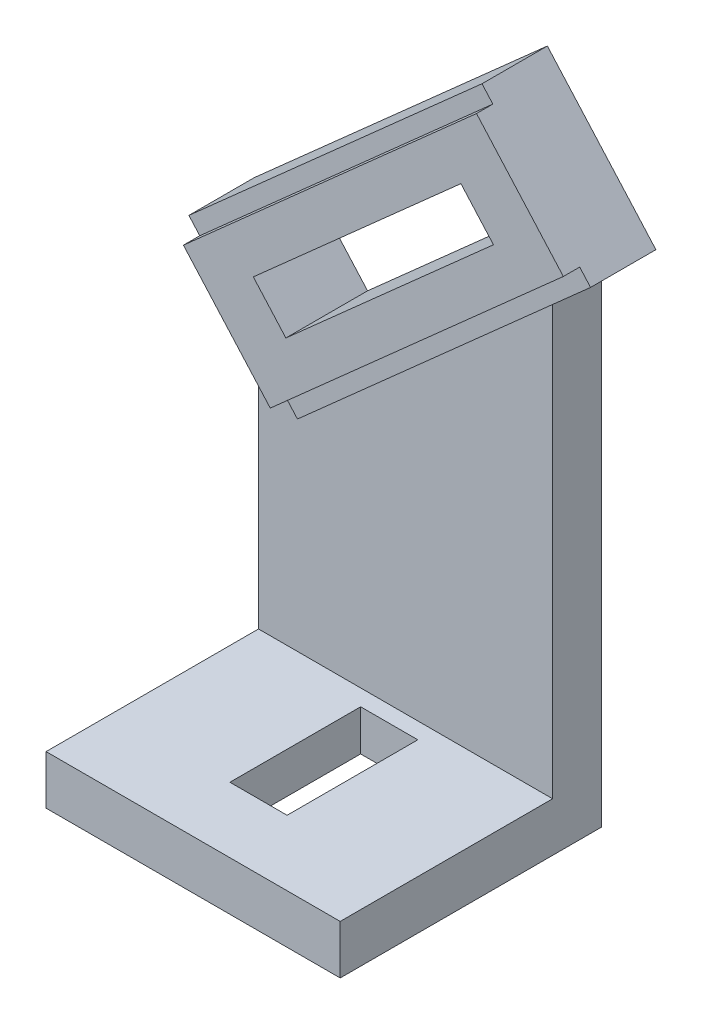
ISO-10303-21;
HEADER;
FILE_DESCRIPTION(('STEP AP214'),'2;1');
FILE_NAME('part.step','',(''),(''),'','','');
FILE_SCHEMA(('AUTOMOTIVE_DESIGN { 1 0 10303 214 1 1 1 1 }'));
ENDSEC;
DATA;
#1=APPLICATION_CONTEXT('core data for automotive mechanical design processes');
#2=APPLICATION_PROTOCOL_DEFINITION('international standard','automotive_design',2000,#1);
#3=PRODUCT_CONTEXT('',#1,'mechanical');
#4=PRODUCT('Part','Part','',(#3));
#5=PRODUCT_RELATED_PRODUCT_CATEGORY('part','',(#4));
#6=PRODUCT_DEFINITION_FORMATION('','',#4);
#7=PRODUCT_DEFINITION_CONTEXT('part definition',#1,'design');
#8=PRODUCT_DEFINITION('design','',#6,#7);
#9=PRODUCT_DEFINITION_SHAPE('','',#8);
#10=(LENGTH_UNIT() NAMED_UNIT(*) SI_UNIT(.MILLI.,.METRE.));
#11=(NAMED_UNIT(*) PLANE_ANGLE_UNIT() SI_UNIT($,.RADIAN.));
#12=(NAMED_UNIT(*) SI_UNIT($,.STERADIAN.) SOLID_ANGLE_UNIT());
#13=UNCERTAINTY_MEASURE_WITH_UNIT(LENGTH_MEASURE(1.E-05),#10,'distance_accuracy_value','');
#14=(GEOMETRIC_REPRESENTATION_CONTEXT(3) GLOBAL_UNCERTAINTY_ASSIGNED_CONTEXT((#13)) GLOBAL_UNIT_ASSIGNED_CONTEXT((#10,
#11,#12)) REPRESENTATION_CONTEXT('',''));
#15=CARTESIAN_POINT('',(0.,0.,0.));
#16=DIRECTION('',(0.,0.,1.));
#17=DIRECTION('',(1.,0.,0.));
#18=AXIS2_PLACEMENT_3D('',#15,#16,#17);
#19=CARTESIAN_POINT('',(-18.,6.,16.));
#20=DIRECTION('',(0.,1.,0.));
#21=DIRECTION('',(0.,0.,1.));
#22=AXIS2_PLACEMENT_3D('',#19,#20,#21);
#23=PLANE('',#22);
#24=DIRECTION('',(1.,0.,0.));
#25=VECTOR('',#24,1.);
#26=CARTESIAN_POINT('',(-3.5,6.,8.));
#27=LINE('',#26,#25);
#28=CARTESIAN_POINT('',(-3.5,6.,8.));
#29=VERTEX_POINT('',#28);
#30=CARTESIAN_POINT('',(3.5,6.,8.));
#31=VERTEX_POINT('',#30);
#32=EDGE_CURVE('E376',#29,#31,#27,.T.);
#33=ORIENTED_EDGE('',*,*,#32,.F.);
#34=DIRECTION('',(0.,0.,1.));
#35=VECTOR('',#34,1.);
#36=CARTESIAN_POINT('',(-3.5,6.,-8.));
#37=LINE('',#36,#35);
#38=CARTESIAN_POINT('',(-3.5,6.,-8.));
#39=VERTEX_POINT('',#38);
#40=EDGE_CURVE('E374',#39,#29,#37,.T.);
#41=ORIENTED_EDGE('',*,*,#40,.F.);
#42=DIRECTION('',(-1.,0.,0.));
#43=VECTOR('',#42,1.);
#44=CARTESIAN_POINT('',(-3.5,6.,-8.));
#45=LINE('',#44,#43);
#46=CARTESIAN_POINT('',(3.5,6.,-8.));
#47=VERTEX_POINT('',#46);
#48=EDGE_CURVE('E381',#47,#39,#45,.T.);
#49=ORIENTED_EDGE('',*,*,#48,.F.);
#50=DIRECTION('',(0.,0.,-1.));
#51=VECTOR('',#50,1.);
#52=CARTESIAN_POINT('',(3.5,6.,-8.));
#53=LINE('',#52,#51);
#54=EDGE_CURVE('E378',#31,#47,#53,.T.);
#55=ORIENTED_EDGE('',*,*,#54,.F.);
#56=EDGE_LOOP('',(#33,#41,#49,#55));
#57=FACE_BOUND('',#56,.T.);
#58=DIRECTION('',(0.,0.,-1.));
#59=VECTOR('',#58,1.);
#60=CARTESIAN_POINT('',(18.,6.,-16.));
#61=LINE('',#60,#59);
#62=CARTESIAN_POINT('',(18.,6.,16.));
#63=VERTEX_POINT('',#62);
#64=CARTESIAN_POINT('',(18.,6.,-10.));
#65=VERTEX_POINT('',#64);
#66=EDGE_CURVE('E401',#63,#65,#61,.T.);
#67=ORIENTED_EDGE('',*,*,#66,.T.);
#68=DIRECTION('',(-1.,0.,0.));
#69=VECTOR('',#68,1.);
#70=CARTESIAN_POINT('',(-18.,6.,-10.));
#71=LINE('',#70,#69);
#72=CARTESIAN_POINT('',(-18.,6.,-10.));
#73=VERTEX_POINT('',#72);
#74=EDGE_CURVE('E349',#65,#73,#71,.T.);
#75=ORIENTED_EDGE('',*,*,#74,.T.);
#76=DIRECTION('',(0.,0.,1.));
#77=VECTOR('',#76,1.);
#78=CARTESIAN_POINT('',(-18.,6.,-16.));
#79=LINE('',#78,#77);
#80=CARTESIAN_POINT('',(-18.,6.,16.));
#81=VERTEX_POINT('',#80);
#82=EDGE_CURVE('E396',#73,#81,#79,.T.);
#83=ORIENTED_EDGE('',*,*,#82,.T.);
#84=DIRECTION('',(1.,0.,0.));
#85=VECTOR('',#84,1.);
#86=CARTESIAN_POINT('',(-18.,6.,16.));
#87=LINE('',#86,#85);
#88=EDGE_CURVE('E398',#81,#63,#87,.T.);
#89=ORIENTED_EDGE('',*,*,#88,.T.);
#90=EDGE_LOOP('',(#67,#75,#83,#89));
#91=FACE_BOUND('',#90,.T.);
#92=ADVANCED_FACE('F30',(#57,#91),#23,.T.);
#93=CARTESIAN_POINT('',(-10.,1.,12.));
#94=DIRECTION('',(-1.,0.,0.));
#95=DIRECTION('',(0.,0.,1.));
#96=AXIS2_PLACEMENT_3D('',#93,#94,#95);
#97=PLANE('',#96);
#98=DIRECTION('',(0.,-1.,0.));
#99=VECTOR('',#98,1.);
#100=CARTESIAN_POINT('',(-10.,1.,-10.));
#101=LINE('',#100,#99);
#102=CARTESIAN_POINT('',(-10.,0.5,-10.));
#103=VERTEX_POINT('',#102);
#104=CARTESIAN_POINT('',(-10.,0.,-10.));
#105=VERTEX_POINT('',#104);
#106=EDGE_CURVE('E346',#103,#105,#101,.T.);
#107=ORIENTED_EDGE('',*,*,#106,.F.);
#108=DIRECTION('',(0.,0.,-1.));
#109=VECTOR('',#108,1.);
#110=CARTESIAN_POINT('',(-10.,0.5,12.));
#111=LINE('',#110,#109);
#112=CARTESIAN_POINT('',(-10.,0.5,12.));
#113=VERTEX_POINT('',#112);
#114=EDGE_CURVE('E437',#103,#113,#111,.F.);
#115=ORIENTED_EDGE('',*,*,#114,.T.);
#116=DIRECTION('',(0.,-1.,0.));
#117=VECTOR('',#116,1.);
#118=CARTESIAN_POINT('',(-10.,1.,12.));
#119=LINE('',#118,#117);
#120=CARTESIAN_POINT('',(-10.,0.,12.));
#121=VERTEX_POINT('',#120);
#122=EDGE_CURVE('E361',#113,#121,#119,.T.);
#123=ORIENTED_EDGE('',*,*,#122,.T.);
#124=DIRECTION('',(0.,0.,-1.));
#125=VECTOR('',#124,1.);
#126=CARTESIAN_POINT('',(-10.,0.,12.));
#127=LINE('',#126,#125);
#128=EDGE_CURVE('E352',#121,#105,#127,.T.);
#129=ORIENTED_EDGE('',*,*,#128,.T.);
#130=EDGE_LOOP('',(#107,#115,#123,#129));
#131=FACE_BOUND('',#130,.T.);
#132=ADVANCED_FACE('F531',(#131),#97,.F.);
#133=CARTESIAN_POINT('',(10.,1.,12.));
#134=DIRECTION('',(1.,0.,0.));
#135=DIRECTION('',(0.,0.,-1.));
#136=AXIS2_PLACEMENT_3D('',#133,#134,#135);
#137=PLANE('',#136);
#138=DIRECTION('',(0.,1.,0.));
#139=VECTOR('',#138,1.);
#140=CARTESIAN_POINT('',(10.,1.,-10.));
#141=LINE('',#140,#139);
#142=CARTESIAN_POINT('',(10.,0.,-10.));
#143=VERTEX_POINT('',#142);
#144=CARTESIAN_POINT('',(10.,0.5,-10.));
#145=VERTEX_POINT('',#144);
#146=EDGE_CURVE('E340',#143,#145,#141,.T.);
#147=ORIENTED_EDGE('',*,*,#146,.F.);
#148=DIRECTION('',(0.,0.,1.));
#149=VECTOR('',#148,1.);
#150=CARTESIAN_POINT('',(10.,0.,12.));
#151=LINE('',#150,#149);
#152=CARTESIAN_POINT('',(10.,0.,12.));
#153=VERTEX_POINT('',#152);
#154=EDGE_CURVE('E354',#143,#153,#151,.T.);
#155=ORIENTED_EDGE('',*,*,#154,.T.);
#156=DIRECTION('',(0.,-1.,0.));
#157=VECTOR('',#156,1.);
#158=CARTESIAN_POINT('',(10.,1.,12.));
#159=LINE('',#158,#157);
#160=CARTESIAN_POINT('',(10.,0.5,12.));
#161=VERTEX_POINT('',#160);
#162=EDGE_CURVE('E360',#161,#153,#159,.T.);
#163=ORIENTED_EDGE('',*,*,#162,.F.);
#164=DIRECTION('',(0.,0.,1.));
#165=VECTOR('',#164,1.);
#166=CARTESIAN_POINT('',(10.,0.5,12.));
#167=LINE('',#166,#165);
#168=EDGE_CURVE('E432',#161,#145,#167,.F.);
#169=ORIENTED_EDGE('',*,*,#168,.T.);
#170=EDGE_LOOP('',(#147,#155,#163,#169));
#171=FACE_BOUND('',#170,.T.);
#172=ADVANCED_FACE('F536',(#171),#137,.F.);
#173=CARTESIAN_POINT('',(-10.,1.,-12.));
#174=DIRECTION('',(0.,-1.,0.));
#175=DIRECTION('',(0.,0.,-1.));
#176=AXIS2_PLACEMENT_3D('',#173,#174,#175);
#177=PLANE('',#176);
#178=DIRECTION('',(-1.,0.,0.));
#179=VECTOR('',#178,1.);
#180=CARTESIAN_POINT('',(-3.5,1.,8.));
#181=LINE('',#180,#179);
#182=CARTESIAN_POINT('',(3.5,1.,8.));
#183=VERTEX_POINT('',#182);
#184=CARTESIAN_POINT('',(-3.5,1.,8.));
#185=VERTEX_POINT('',#184);
#186=EDGE_CURVE('E368',#183,#185,#181,.T.);
#187=ORIENTED_EDGE('',*,*,#186,.F.);
#188=DIRECTION('',(0.,0.,1.));
#189=VECTOR('',#188,1.);
#190=CARTESIAN_POINT('',(3.5,1.,-8.));
#191=LINE('',#190,#189);
#192=CARTESIAN_POINT('',(3.5,1.,-8.));
#193=VERTEX_POINT('',#192);
#194=EDGE_CURVE('E363',#193,#183,#191,.T.);
#195=ORIENTED_EDGE('',*,*,#194,.F.);
#196=DIRECTION('',(1.,0.,0.));
#197=VECTOR('',#196,1.);
#198=CARTESIAN_POINT('',(-3.5,1.,-8.));
#199=LINE('',#198,#197);
#200=CARTESIAN_POINT('',(-3.5,1.,-8.));
#201=VERTEX_POINT('',#200);
#202=EDGE_CURVE('E422',#201,#193,#199,.T.);
#203=ORIENTED_EDGE('',*,*,#202,.F.);
#204=DIRECTION('',(0.,0.,-1.));
#205=VECTOR('',#204,1.);
#206=CARTESIAN_POINT('',(-3.5,1.,-8.));
#207=LINE('',#206,#205);
#208=EDGE_CURVE('E371',#185,#201,#207,.T.);
#209=ORIENTED_EDGE('',*,*,#208,.F.);
#210=EDGE_LOOP('',(#187,#195,#203,#209));
#211=FACE_BOUND('',#210,.T.);
#212=DIRECTION('',(0.,0.,-1.));
#213=VECTOR('',#212,1.);
#214=CARTESIAN_POINT('',(-9.5,1.,-12.));
#215=LINE('',#214,#213);
#216=CARTESIAN_POINT('',(-9.5,1.,11.5));
#217=VERTEX_POINT('',#216);
#218=CARTESIAN_POINT('',(-9.5,1.,-10.));
#219=VERTEX_POINT('',#218);
#220=EDGE_CURVE('E425',#217,#219,#215,.T.);
#221=ORIENTED_EDGE('',*,*,#220,.T.);
#222=DIRECTION('',(1.,0.,0.));
#223=VECTOR('',#222,1.);
#224=CARTESIAN_POINT('',(-10.,1.,-10.));
#225=LINE('',#224,#223);
#226=CARTESIAN_POINT('',(9.5,1.,-10.));
#227=VERTEX_POINT('',#226);
#228=EDGE_CURVE('E337',#219,#227,#225,.T.);
#229=ORIENTED_EDGE('',*,*,#228,.T.);
#230=DIRECTION('',(0.,0.,1.));
#231=VECTOR('',#230,1.);
#232=CARTESIAN_POINT('',(9.5,1.,-12.));
#233=LINE('',#232,#231);
#234=CARTESIAN_POINT('',(9.5,1.,11.5));
#235=VERTEX_POINT('',#234);
#236=EDGE_CURVE('E430',#227,#235,#233,.T.);
#237=ORIENTED_EDGE('',*,*,#236,.T.);
#238=DIRECTION('',(-1.,0.,0.));
#239=VECTOR('',#238,1.);
#240=CARTESIAN_POINT('',(-10.,1.,11.5));
#241=LINE('',#240,#239);
#242=EDGE_CURVE('E428',#235,#217,#241,.T.);
#243=ORIENTED_EDGE('',*,*,#242,.T.);
#244=EDGE_LOOP('',(#221,#229,#237,#243));
#245=FACE_BOUND('',#244,.T.);
#246=ADVANCED_FACE('F555',(#211,#245),#177,.T.);
#247=CARTESIAN_POINT('',(-9.5,0.5,-12.));
#248=DIRECTION('',(0.,0.,-1.));
#249=DIRECTION('',(-1.,0.,0.));
#250=AXIS2_PLACEMENT_3D('',#247,#248,#249);
#251=CYLINDRICAL_SURFACE('',#250,0.5);
#252=CARTESIAN_POINT('',(-9.5,0.5,-10.));
#253=DIRECTION('',(0.,0.,-1.));
#254=DIRECTION('',(-1.,0.,0.));
#255=AXIS2_PLACEMENT_3D('',#252,#253,#254);
#256=CIRCLE('',#255,0.5);
#257=EDGE_CURVE('E343',#219,#103,#256,.F.);
#258=ORIENTED_EDGE('',*,*,#257,.F.);
#259=ORIENTED_EDGE('',*,*,#220,.F.);
#260=CARTESIAN_POINT('',(-9.5,0.5,11.5));
#261=DIRECTION('',(-0.707106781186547,0.,-0.707106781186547));
#262=DIRECTION('',(-0.707106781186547,0.,0.707106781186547));
#263=AXIS2_PLACEMENT_3D('',#260,#261,#262);
#264=ELLIPSE('',#263,0.707106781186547,0.5);
#265=EDGE_CURVE('E355',#217,#113,#264,.F.);
#266=ORIENTED_EDGE('',*,*,#265,.T.);
#267=ORIENTED_EDGE('',*,*,#114,.F.);
#268=EDGE_LOOP('',(#258,#259,#266,#267));
#269=FACE_BOUND('',#268,.T.);
#270=ADVANCED_FACE('F563',(#269),#251,.F.);
#271=CARTESIAN_POINT('',(9.5,0.5,-12.));
#272=DIRECTION('',(0.,0.,1.));
#273=DIRECTION('',(1.,0.,0.));
#274=AXIS2_PLACEMENT_3D('',#271,#272,#273);
#275=CYLINDRICAL_SURFACE('',#274,0.5);
#276=CARTESIAN_POINT('',(9.5,0.5,-10.));
#277=DIRECTION('',(0.,0.,-1.));
#278=DIRECTION('',(-1.,0.,0.));
#279=AXIS2_PLACEMENT_3D('',#276,#277,#278);
#280=CIRCLE('',#279,0.5);
#281=EDGE_CURVE('E439',#145,#227,#280,.F.);
#282=ORIENTED_EDGE('',*,*,#281,.F.);
#283=ORIENTED_EDGE('',*,*,#168,.F.);
#284=CARTESIAN_POINT('',(9.5,0.5,11.5));
#285=DIRECTION('',(-0.707106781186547,0.,0.707106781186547));
#286=DIRECTION('',(0.707106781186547,0.,0.707106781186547));
#287=AXIS2_PLACEMENT_3D('',#284,#285,#286);
#288=ELLIPSE('',#287,0.707106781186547,0.5);
#289=EDGE_CURVE('E351',#161,#235,#288,.T.);
#290=ORIENTED_EDGE('',*,*,#289,.T.);
#291=ORIENTED_EDGE('',*,*,#236,.F.);
#292=EDGE_LOOP('',(#282,#283,#290,#291));
#293=FACE_BOUND('',#292,.T.);
#294=ADVANCED_FACE('F545',(#293),#275,.F.);
#295=CARTESIAN_POINT('',(-3.5,6.,-8.));
#296=DIRECTION('',(1.,0.,0.));
#297=DIRECTION('',(0.,0.,-1.));
#298=AXIS2_PLACEMENT_3D('',#295,#296,#297);
#299=PLANE('',#298);
#300=DIRECTION('',(0.,-1.,0.));
#301=VECTOR('',#300,1.);
#302=CARTESIAN_POINT('',(-3.5,6.,8.));
#303=LINE('',#302,#301);
#304=EDGE_CURVE('E392',#29,#185,#303,.T.);
#305=ORIENTED_EDGE('',*,*,#304,.T.);
#306=ORIENTED_EDGE('',*,*,#208,.T.);
#307=DIRECTION('',(0.,-1.,0.));
#308=VECTOR('',#307,1.);
#309=CARTESIAN_POINT('',(-3.5,6.,-8.));
#310=LINE('',#309,#308);
#311=EDGE_CURVE('E383',#39,#201,#310,.T.);
#312=ORIENTED_EDGE('',*,*,#311,.F.);
#313=ORIENTED_EDGE('',*,*,#40,.T.);
#314=EDGE_LOOP('',(#305,#306,#312,#313));
#315=FACE_BOUND('',#314,.T.);
#316=ADVANCED_FACE('F541',(#315),#299,.T.);
#317=CARTESIAN_POINT('',(-3.5,6.,8.));
#318=DIRECTION('',(0.,0.,-1.));
#319=DIRECTION('',(-1.,0.,0.));
#320=AXIS2_PLACEMENT_3D('',#317,#318,#319);
#321=PLANE('',#320);
#322=DIRECTION('',(0.,-1.,0.));
#323=VECTOR('',#322,1.);
#324=CARTESIAN_POINT('',(3.5,6.,8.));
#325=LINE('',#324,#323);
#326=EDGE_CURVE('E389',#31,#183,#325,.T.);
#327=ORIENTED_EDGE('',*,*,#326,.T.);
#328=ORIENTED_EDGE('',*,*,#186,.T.);
#329=ORIENTED_EDGE('',*,*,#304,.F.);
#330=ORIENTED_EDGE('',*,*,#32,.T.);
#331=EDGE_LOOP('',(#327,#328,#329,#330));
#332=FACE_BOUND('',#331,.T.);
#333=ADVANCED_FACE('F544',(#332),#321,.T.);
#334=CARTESIAN_POINT('',(3.5,6.,-8.));
#335=DIRECTION('',(-1.,0.,0.));
#336=DIRECTION('',(0.,0.,1.));
#337=AXIS2_PLACEMENT_3D('',#334,#335,#336);
#338=PLANE('',#337);
#339=DIRECTION('',(0.,-1.,0.));
#340=VECTOR('',#339,1.);
#341=CARTESIAN_POINT('',(3.5,6.,-8.));
#342=LINE('',#341,#340);
#343=EDGE_CURVE('E386',#47,#193,#342,.T.);
#344=ORIENTED_EDGE('',*,*,#343,.T.);
#345=ORIENTED_EDGE('',*,*,#194,.T.);
#346=ORIENTED_EDGE('',*,*,#326,.F.);
#347=ORIENTED_EDGE('',*,*,#54,.T.);
#348=EDGE_LOOP('',(#344,#345,#346,#347));
#349=FACE_BOUND('',#348,.T.);
#350=ADVANCED_FACE('F524',(#349),#338,.T.);
#351=CARTESIAN_POINT('',(-3.5,6.,-8.));
#352=DIRECTION('',(0.,0.,1.));
#353=DIRECTION('',(1.,0.,0.));
#354=AXIS2_PLACEMENT_3D('',#351,#352,#353);
#355=PLANE('',#354);
#356=ORIENTED_EDGE('',*,*,#311,.T.);
#357=ORIENTED_EDGE('',*,*,#202,.T.);
#358=ORIENTED_EDGE('',*,*,#343,.F.);
#359=ORIENTED_EDGE('',*,*,#48,.T.);
#360=EDGE_LOOP('',(#356,#357,#358,#359));
#361=FACE_BOUND('',#360,.T.);
#362=ADVANCED_FACE('F516',(#361),#355,.T.);
#363=CARTESIAN_POINT('',(-18.,0.,16.));
#364=DIRECTION('',(0.,1.,0.));
#365=DIRECTION('',(0.,0.,1.));
#366=AXIS2_PLACEMENT_3D('',#363,#364,#365);
#367=PLANE('',#366);
#368=ORIENTED_EDGE('',*,*,#154,.F.);
#369=DIRECTION('',(-1.,0.,0.));
#370=VECTOR('',#369,1.);
#371=CARTESIAN_POINT('',(-18.,0.,-10.));
#372=LINE('',#371,#370);
#373=EDGE_CURVE('E329',#143,#105,#372,.T.);
#374=ORIENTED_EDGE('',*,*,#373,.T.);
#375=ORIENTED_EDGE('',*,*,#128,.F.);
#376=DIRECTION('',(-1.,0.,0.));
#377=VECTOR('',#376,1.);
#378=CARTESIAN_POINT('',(-10.,0.,12.));
#379=LINE('',#378,#377);
#380=EDGE_CURVE('E357',#153,#121,#379,.T.);
#381=ORIENTED_EDGE('',*,*,#380,.F.);
#382=EDGE_LOOP('',(#368,#374,#375,#381));
#383=FACE_BOUND('',#382,.T.);
#384=DIRECTION('',(-1.,0.,0.));
#385=VECTOR('',#384,1.);
#386=CARTESIAN_POINT('',(-18.,0.,-16.));
#387=LINE('',#386,#385);
#388=CARTESIAN_POINT('',(18.,0.,-16.));
#389=VERTEX_POINT('',#388);
#390=CARTESIAN_POINT('',(-18.,0.,-16.));
#391=VERTEX_POINT('',#390);
#392=EDGE_CURVE('E399',#389,#391,#387,.T.);
#393=ORIENTED_EDGE('',*,*,#392,.F.);
#394=DIRECTION('',(0.,0.,-1.));
#395=VECTOR('',#394,1.);
#396=CARTESIAN_POINT('',(18.,0.,-16.));
#397=LINE('',#396,#395);
#398=CARTESIAN_POINT('',(18.,0.,16.));
#399=VERTEX_POINT('',#398);
#400=EDGE_CURVE('E408',#399,#389,#397,.T.);
#401=ORIENTED_EDGE('',*,*,#400,.F.);
#402=DIRECTION('',(1.,0.,0.));
#403=VECTOR('',#402,1.);
#404=CARTESIAN_POINT('',(-18.,0.,16.));
#405=LINE('',#404,#403);
#406=CARTESIAN_POINT('',(-18.,0.,16.));
#407=VERTEX_POINT('',#406);
#408=EDGE_CURVE('E406',#407,#399,#405,.T.);
#409=ORIENTED_EDGE('',*,*,#408,.F.);
#410=DIRECTION('',(0.,0.,1.));
#411=VECTOR('',#410,1.);
#412=CARTESIAN_POINT('',(-18.,0.,-16.));
#413=LINE('',#412,#411);
#414=EDGE_CURVE('E395',#391,#407,#413,.T.);
#415=ORIENTED_EDGE('',*,*,#414,.F.);
#416=EDGE_LOOP('',(#393,#401,#409,#415));
#417=FACE_BOUND('',#416,.T.);
#418=ADVANCED_FACE('F513',(#383,#417),#367,.F.);
#419=CARTESIAN_POINT('',(-18.,6.,-16.));
#420=DIRECTION('',(1.,0.,0.));
#421=DIRECTION('',(0.,0.,-1.));
#422=AXIS2_PLACEMENT_3D('',#419,#420,#421);
#423=PLANE('',#422);
#424=ORIENTED_EDGE('',*,*,#414,.T.);
#425=DIRECTION('',(0.,-1.,0.));
#426=VECTOR('',#425,1.);
#427=CARTESIAN_POINT('',(-18.,6.,16.));
#428=LINE('',#427,#426);
#429=EDGE_CURVE('E419',#81,#407,#428,.T.);
#430=ORIENTED_EDGE('',*,*,#429,.F.);
#431=ORIENTED_EDGE('',*,*,#82,.F.);
#432=DIRECTION('',(0.,1.,0.));
#433=VECTOR('',#432,1.);
#434=CARTESIAN_POINT('',(-18.,0.,-10.));
#435=LINE('',#434,#433);
#436=CARTESIAN_POINT('',(-18.,40.,-10.));
#437=VERTEX_POINT('',#436);
#438=EDGE_CURVE('E322',#73,#437,#435,.T.);
#439=ORIENTED_EDGE('',*,*,#438,.T.);
#440=DIRECTION('',(0.,0.,-1.));
#441=VECTOR('',#440,1.);
#442=CARTESIAN_POINT('',(-18.,40.,-10.));
#443=LINE('',#442,#441);
#444=CARTESIAN_POINT('',(-18.,40.,-16.));
#445=VERTEX_POINT('',#444);
#446=EDGE_CURVE('E332',#437,#445,#443,.T.);
#447=ORIENTED_EDGE('',*,*,#446,.T.);
#448=DIRECTION('',(0.,-1.,0.));
#449=VECTOR('',#448,1.);
#450=CARTESIAN_POINT('',(-18.,6.,-16.));
#451=LINE('',#450,#449);
#452=EDGE_CURVE('E404',#445,#391,#451,.T.);
#453=ORIENTED_EDGE('',*,*,#452,.T.);
#454=EDGE_LOOP('',(#424,#430,#431,#439,#447,#453));
#455=FACE_BOUND('',#454,.T.);
#456=ADVANCED_FACE('F504',(#455),#423,.F.);
#457=CARTESIAN_POINT('',(-18.,6.,16.));
#458=DIRECTION('',(0.,0.,-1.));
#459=DIRECTION('',(-1.,0.,0.));
#460=AXIS2_PLACEMENT_3D('',#457,#458,#459);
#461=PLANE('',#460);
#462=ORIENTED_EDGE('',*,*,#408,.T.);
#463=DIRECTION('',(0.,-1.,0.));
#464=VECTOR('',#463,1.);
#465=CARTESIAN_POINT('',(18.,6.,16.));
#466=LINE('',#465,#464);
#467=EDGE_CURVE('E416',#63,#399,#466,.T.);
#468=ORIENTED_EDGE('',*,*,#467,.F.);
#469=ORIENTED_EDGE('',*,*,#88,.F.);
#470=ORIENTED_EDGE('',*,*,#429,.T.);
#471=EDGE_LOOP('',(#462,#468,#469,#470));
#472=FACE_BOUND('',#471,.T.);
#473=ADVANCED_FACE('F510',(#472),#461,.F.);
#474=CARTESIAN_POINT('',(18.,6.,-16.));
#475=DIRECTION('',(-1.,0.,0.));
#476=DIRECTION('',(0.,0.,1.));
#477=AXIS2_PLACEMENT_3D('',#474,#475,#476);
#478=PLANE('',#477);
#479=DIRECTION('',(0.,-1.,0.));
#480=VECTOR('',#479,1.);
#481=CARTESIAN_POINT('',(18.,6.,-16.));
#482=LINE('',#481,#480);
#483=CARTESIAN_POINT('',(18.,58.6204504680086,-16.));
#484=VERTEX_POINT('',#483);
#485=EDGE_CURVE('E414',#484,#389,#482,.T.);
#486=ORIENTED_EDGE('',*,*,#485,.F.);
#487=DIRECTION('',(0.,0.,1.));
#488=VECTOR('',#487,1.);
#489=CARTESIAN_POINT('',(18.,58.6204504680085,-16.));
#490=LINE('',#489,#488);
#491=CARTESIAN_POINT('',(18.,58.6204504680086,-10.));
#492=VERTEX_POINT('',#491);
#493=EDGE_CURVE('E311',#484,#492,#490,.T.);
#494=ORIENTED_EDGE('',*,*,#493,.T.);
#495=DIRECTION('',(0.,-1.,0.));
#496=VECTOR('',#495,1.);
#497=CARTESIAN_POINT('',(18.,0.,-10.));
#498=LINE('',#497,#496);
#499=EDGE_CURVE('E327',#492,#65,#498,.T.);
#500=ORIENTED_EDGE('',*,*,#499,.T.);
#501=ORIENTED_EDGE('',*,*,#66,.F.);
#502=ORIENTED_EDGE('',*,*,#467,.T.);
#503=ORIENTED_EDGE('',*,*,#400,.T.);
#504=EDGE_LOOP('',(#486,#494,#500,#501,#502,#503));
#505=FACE_BOUND('',#504,.T.);
#506=ADVANCED_FACE('F459',(#505),#478,.F.);
#507=CARTESIAN_POINT('',(-18.,6.,-16.));
#508=DIRECTION('',(0.,0.,1.));
#509=DIRECTION('',(1.,0.,0.));
#510=AXIS2_PLACEMENT_3D('',#507,#508,#509);
#511=PLANE('',#510);
#512=DIRECTION('',(-0.747409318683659,-0.664363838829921,0.));
#513=VECTOR('',#512,1.);
#514=CARTESIAN_POINT('',(-14.6368735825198,47.0033105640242,-16.));
#515=LINE('',#514,#513);
#516=CARTESIAN_POINT('',(10.7750432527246,69.5916810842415,-16.));
#517=VERTEX_POINT('',#516);
#518=CARTESIAN_POINT('',(-14.6368735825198,47.0033105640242,-16.));
#519=VERTEX_POINT('',#518);
#520=EDGE_CURVE('E229',#517,#519,#515,.T.);
#521=ORIENTED_EDGE('',*,*,#520,.T.);
#522=DIRECTION('',(0.664363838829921,-0.747409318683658,0.));
#523=VECTOR('',#522,1.);
#524=CARTESIAN_POINT('',(-10.6506905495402,42.5188546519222,-16.));
#525=LINE('',#524,#523);
#526=CARTESIAN_POINT('',(-10.6506905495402,42.5188546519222,-16.));
#527=VERTEX_POINT('',#526);
#528=EDGE_CURVE('E223',#519,#527,#525,.T.);
#529=ORIENTED_EDGE('',*,*,#528,.T.);
#530=DIRECTION('',(0.747409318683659,0.664363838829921,0.));
#531=VECTOR('',#530,1.);
#532=CARTESIAN_POINT('',(14.7612262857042,65.1072251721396,-16.));
#533=LINE('',#532,#531);
#534=CARTESIAN_POINT('',(14.7612262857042,65.1072251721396,-16.));
#535=VERTEX_POINT('',#534);
#536=EDGE_CURVE('E232',#527,#535,#533,.T.);
#537=ORIENTED_EDGE('',*,*,#536,.T.);
#538=DIRECTION('',(-0.664363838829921,0.747409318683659,0.));
#539=VECTOR('',#538,1.);
#540=CARTESIAN_POINT('',(10.7750432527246,69.5916810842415,-16.));
#541=LINE('',#540,#539);
#542=EDGE_CURVE('E45',#535,#517,#541,.T.);
#543=ORIENTED_EDGE('',*,*,#542,.T.);
#544=EDGE_LOOP('',(#521,#529,#537,#543));
#545=FACE_BOUND('',#544,.T.);
#546=DIRECTION('',(0.74740931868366,0.66436383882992,0.));
#547=VECTOR('',#546,1.);
#548=CARTESIAN_POINT('',(18.,72.,-16.));
#549=LINE('',#548,#547);
#550=CARTESIAN_POINT('',(-17.8756472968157,40.1105357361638,-16.));
#551=VERTEX_POINT('',#550);
#552=EDGE_CURVE('E321',#445,#551,#549,.T.);
#553=ORIENTED_EDGE('',*,*,#552,.T.);
#554=DIRECTION('',(-0.66436383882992,0.74740931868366,0.));
#555=VECTOR('',#554,1.);
#556=CARTESIAN_POINT('',(-11.2320089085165,32.6364425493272,-16.));
#557=LINE('',#556,#555);
#558=CARTESIAN_POINT('',(-24.5192856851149,47.5846289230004,-16.));
#559=VERTEX_POINT('',#558);
#560=EDGE_CURVE('E304',#551,#559,#557,.T.);
#561=ORIENTED_EDGE('',*,*,#560,.T.);
#562=DIRECTION('',(0.74740931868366,0.664363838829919,0.));
#563=VECTOR('',#562,1.);
#564=CARTESIAN_POINT('',(-24.5192856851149,47.5846289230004,-16.));
#565=LINE('',#564,#563);
#566=CARTESIAN_POINT('',(11.3563616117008,79.4740931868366,-16.));
#567=VERTEX_POINT('',#566);
#568=EDGE_CURVE('E295',#559,#567,#565,.T.);
#569=ORIENTED_EDGE('',*,*,#568,.T.);
#570=DIRECTION('',(0.66436383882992,-0.74740931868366,0.));
#571=VECTOR('',#570,1.);
#572=CARTESIAN_POINT('',(11.3563616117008,79.4740931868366,-16.));
#573=LINE('',#572,#571);
#574=CARTESIAN_POINT('',(24.6436383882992,64.5259068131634,-16.));
#575=VERTEX_POINT('',#574);
#576=EDGE_CURVE('E289',#567,#575,#573,.T.);
#577=ORIENTED_EDGE('',*,*,#576,.T.);
#578=DIRECTION('',(-0.74740931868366,-0.66436383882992,0.));
#579=VECTOR('',#578,1.);
#580=CARTESIAN_POINT('',(24.6436383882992,64.5259068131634,-16.));
#581=LINE('',#580,#579);
#582=EDGE_CURVE('E301',#575,#484,#581,.T.);
#583=ORIENTED_EDGE('',*,*,#582,.T.);
#584=ORIENTED_EDGE('',*,*,#485,.T.);
#585=ORIENTED_EDGE('',*,*,#392,.T.);
#586=ORIENTED_EDGE('',*,*,#452,.F.);
#587=EDGE_LOOP('',(#553,#561,#569,#577,#583,#584,#585,#586));
#588=FACE_BOUND('',#587,.T.);
#589=ADVANCED_FACE('F236',(#545,#588),#511,.F.);
#590=CARTESIAN_POINT('',(-10.,1.,12.));
#591=DIRECTION('',(0.,0.,1.));
#592=DIRECTION('',(1.,0.,0.));
#593=AXIS2_PLACEMENT_3D('',#590,#591,#592);
#594=PLANE('',#593);
#595=ORIENTED_EDGE('',*,*,#122,.F.);
#596=DIRECTION('',(-1.,0.,0.));
#597=VECTOR('',#596,1.);
#598=CARTESIAN_POINT('',(-10.,0.5,12.));
#599=LINE('',#598,#597);
#600=EDGE_CURVE('E435',#113,#161,#599,.F.);
#601=ORIENTED_EDGE('',*,*,#600,.T.);
#602=ORIENTED_EDGE('',*,*,#162,.T.);
#603=ORIENTED_EDGE('',*,*,#380,.T.);
#604=EDGE_LOOP('',(#595,#601,#602,#603));
#605=FACE_BOUND('',#604,.T.);
#606=ADVANCED_FACE('F557',(#605),#594,.F.);
#607=CARTESIAN_POINT('',(-10.,0.5,11.5));
#608=DIRECTION('',(-1.,0.,0.));
#609=DIRECTION('',(0.,0.,1.));
#610=AXIS2_PLACEMENT_3D('',#607,#608,#609);
#611=CYLINDRICAL_SURFACE('',#610,0.5);
#612=ORIENTED_EDGE('',*,*,#289,.F.);
#613=ORIENTED_EDGE('',*,*,#600,.F.);
#614=ORIENTED_EDGE('',*,*,#265,.F.);
#615=ORIENTED_EDGE('',*,*,#242,.F.);
#616=EDGE_LOOP('',(#612,#613,#614,#615));
#617=FACE_BOUND('',#616,.T.);
#618=ADVANCED_FACE('F32',(#617),#611,.F.);
#619=CARTESIAN_POINT('',(-18.,0.,-10.));
#620=DIRECTION('',(0.,0.,-1.));
#621=DIRECTION('',(-1.,0.,0.));
#622=AXIS2_PLACEMENT_3D('',#619,#620,#621);
#623=PLANE('',#622);
#624=ORIENTED_EDGE('',*,*,#257,.T.);
#625=ORIENTED_EDGE('',*,*,#106,.T.);
#626=ORIENTED_EDGE('',*,*,#373,.F.);
#627=ORIENTED_EDGE('',*,*,#146,.T.);
#628=ORIENTED_EDGE('',*,*,#281,.T.);
#629=ORIENTED_EDGE('',*,*,#228,.F.);
#630=EDGE_LOOP('',(#624,#625,#626,#627,#628,#629));
#631=FACE_BOUND('',#630,.T.);
#632=ADVANCED_FACE('F567',(#631),#623,.F.);
#633=CARTESIAN_POINT('',(18.,72.,-10.));
#634=DIRECTION('',(-0.66436383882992,0.74740931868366,0.));
#635=DIRECTION('',(-0.74740931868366,-0.66436383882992,0.));
#636=AXIS2_PLACEMENT_3D('',#633,#634,#635);
#637=PLANE('',#636);
#638=DIRECTION('',(0.,0.,1.));
#639=VECTOR('',#638,1.);
#640=CARTESIAN_POINT('',(-17.8756472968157,40.1105357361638,-10.));
#641=LINE('',#640,#639);
#642=CARTESIAN_POINT('',(-17.8756472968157,40.1105357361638,-10.));
#643=VERTEX_POINT('',#642);
#644=EDGE_CURVE('E319',#551,#643,#641,.T.);
#645=ORIENTED_EDGE('',*,*,#644,.F.);
#646=ORIENTED_EDGE('',*,*,#552,.F.);
#647=ORIENTED_EDGE('',*,*,#446,.F.);
#648=DIRECTION('',(0.74740931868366,0.66436383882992,0.));
#649=VECTOR('',#648,1.);
#650=CARTESIAN_POINT('',(18.,72.,-10.));
#651=LINE('',#650,#649);
#652=EDGE_CURVE('E324',#437,#643,#651,.T.);
#653=ORIENTED_EDGE('',*,*,#652,.T.);
#654=EDGE_LOOP('',(#645,#646,#647,#653));
#655=FACE_BOUND('',#654,.T.);
#656=ADVANCED_FACE('F500',(#655),#637,.T.);
#657=DIRECTION('',(-0.74740931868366,-0.66436383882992,0.));
#658=VECTOR('',#657,1.);
#659=CARTESIAN_POINT('',(-31.218430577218,14.8707343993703,-10.));
#660=LINE('',#659,#658);
#661=CARTESIAN_POINT('',(-11.2320089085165,32.6364425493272,-10.));
#662=VERTEX_POINT('',#661);
#663=EDGE_CURVE('E38',#492,#662,#660,.T.);
#664=ORIENTED_EDGE('',*,*,#663,.T.);
#665=DIRECTION('',(-0.66436383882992,0.74740931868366,0.));
#666=VECTOR('',#665,1.);
#667=CARTESIAN_POINT('',(1.98642166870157,17.7657081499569,-10.));
#668=LINE('',#667,#666);
#669=EDGE_CURVE('E11',#662,#643,#668,.T.);
#670=ORIENTED_EDGE('',*,*,#669,.T.);
#671=ORIENTED_EDGE('',*,*,#652,.F.);
#672=ORIENTED_EDGE('',*,*,#438,.F.);
#673=ORIENTED_EDGE('',*,*,#74,.F.);
#674=ORIENTED_EDGE('',*,*,#499,.F.);
#675=EDGE_LOOP('',(#664,#670,#671,#672,#673,#674));
#676=FACE_BOUND('',#675,.T.);
#677=ADVANCED_FACE('F448',(#676),#623,.F.);
#678=CARTESIAN_POINT('',(24.6436383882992,64.5259068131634,-6.));
#679=DIRECTION('',(0.66436383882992,-0.74740931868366,0.));
#680=DIRECTION('',(0.74740931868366,0.66436383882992,0.));
#681=AXIS2_PLACEMENT_3D('',#678,#679,#680);
#682=PLANE('',#681);
#683=DIRECTION('',(0.74740931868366,0.664363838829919,0.));
#684=VECTOR('',#683,1.);
#685=CARTESIAN_POINT('',(24.6436383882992,64.5259068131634,-8.));
#686=LINE('',#685,#684);
#687=CARTESIAN_POINT('',(-11.2320089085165,32.6364425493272,-8.));
#688=VERTEX_POINT('',#687);
#689=CARTESIAN_POINT('',(24.6436383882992,64.5259068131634,-8.));
#690=VERTEX_POINT('',#689);
#691=EDGE_CURVE('E277',#688,#690,#686,.T.);
#692=ORIENTED_EDGE('',*,*,#691,.F.);
#693=DIRECTION('',(0.,0.,-1.));
#694=VECTOR('',#693,1.);
#695=CARTESIAN_POINT('',(-11.2320089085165,32.6364425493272,-6.));
#696=LINE('',#695,#694);
#697=EDGE_CURVE('E314',#688,#662,#696,.T.);
#698=ORIENTED_EDGE('',*,*,#697,.T.);
#699=ORIENTED_EDGE('',*,*,#663,.F.);
#700=ORIENTED_EDGE('',*,*,#493,.F.);
#701=ORIENTED_EDGE('',*,*,#582,.F.);
#702=DIRECTION('',(0.,0.,-1.));
#703=VECTOR('',#702,1.);
#704=CARTESIAN_POINT('',(24.6436383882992,64.5259068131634,-6.));
#705=LINE('',#704,#703);
#706=EDGE_CURVE('E298',#690,#575,#705,.T.);
#707=ORIENTED_EDGE('',*,*,#706,.F.);
#708=EDGE_LOOP('',(#692,#698,#699,#700,#701,#707));
#709=FACE_BOUND('',#708,.T.);
#710=ADVANCED_FACE('F454',(#709),#682,.T.);
#711=CARTESIAN_POINT('',(11.3563616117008,79.4740931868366,-6.));
#712=DIRECTION('',(0.74740931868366,0.66436383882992,0.));
#713=DIRECTION('',(-0.66436383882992,0.74740931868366,0.));
#714=AXIS2_PLACEMENT_3D('',#711,#712,#713);
#715=PLANE('',#714);
#716=DIRECTION('',(0.,0.,1.));
#717=VECTOR('',#716,1.);
#718=CARTESIAN_POINT('',(12.6850892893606,77.9792745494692,-8.));
#719=LINE('',#718,#717);
#720=CARTESIAN_POINT('',(12.6850892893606,77.9792745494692,-8.));
#721=VERTEX_POINT('',#720);
#722=CARTESIAN_POINT('',(12.6850892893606,77.9792745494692,-6.));
#723=VERTEX_POINT('',#722);
#724=EDGE_CURVE('E268',#721,#723,#719,.T.);
#725=ORIENTED_EDGE('',*,*,#724,.T.);
#726=DIRECTION('',(0.66436383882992,-0.74740931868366,0.));
#727=VECTOR('',#726,1.);
#728=CARTESIAN_POINT('',(11.3563616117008,79.4740931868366,-6.));
#729=LINE('',#728,#727);
#730=CARTESIAN_POINT('',(23.3149107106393,66.0207254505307,-6.));
#731=VERTEX_POINT('',#730);
#732=EDGE_CURVE('E292',#723,#731,#729,.T.);
#733=ORIENTED_EDGE('',*,*,#732,.T.);
#734=DIRECTION('',(0.,0.,1.));
#735=VECTOR('',#734,1.);
#736=CARTESIAN_POINT('',(23.3149107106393,66.0207254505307,-8.));
#737=LINE('',#736,#735);
#738=CARTESIAN_POINT('',(23.3149107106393,66.0207254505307,-8.));
#739=VERTEX_POINT('',#738);
#740=EDGE_CURVE('E284',#739,#731,#737,.T.);
#741=ORIENTED_EDGE('',*,*,#740,.F.);
#742=DIRECTION('',(-0.664363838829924,0.747409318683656,0.));
#743=VECTOR('',#742,1.);
#744=CARTESIAN_POINT('',(23.3149107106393,66.0207254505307,-8.));
#745=LINE('',#744,#743);
#746=EDGE_CURVE('E279',#690,#739,#745,.T.);
#747=ORIENTED_EDGE('',*,*,#746,.F.);
#748=ORIENTED_EDGE('',*,*,#706,.T.);
#749=ORIENTED_EDGE('',*,*,#576,.F.);
#750=DIRECTION('',(0.,0.,-1.));
#751=VECTOR('',#750,1.);
#752=CARTESIAN_POINT('',(11.3563616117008,79.4740931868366,-6.));
#753=LINE('',#752,#751);
#754=CARTESIAN_POINT('',(11.3563616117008,79.4740931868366,-8.));
#755=VERTEX_POINT('',#754);
#756=EDGE_CURVE('E309',#755,#567,#753,.T.);
#757=ORIENTED_EDGE('',*,*,#756,.F.);
#758=DIRECTION('',(-0.664363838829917,0.747409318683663,0.));
#759=VECTOR('',#758,1.);
#760=CARTESIAN_POINT('',(12.6850892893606,77.9792745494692,-8.));
#761=LINE('',#760,#759);
#762=EDGE_CURVE('E261',#721,#755,#761,.T.);
#763=ORIENTED_EDGE('',*,*,#762,.F.);
#764=EDGE_LOOP('',(#725,#733,#741,#747,#748,#749,#757,#763));
#765=FACE_BOUND('',#764,.T.);
#766=ADVANCED_FACE('F467',(#765),#715,.T.);
#767=CARTESIAN_POINT('',(-24.5192856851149,47.5846289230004,-6.));
#768=DIRECTION('',(-0.66436383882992,0.74740931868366,0.));
#769=DIRECTION('',(-0.74740931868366,-0.66436383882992,0.));
#770=AXIS2_PLACEMENT_3D('',#767,#768,#769);
#771=PLANE('',#770);
#772=DIRECTION('',(-0.74740931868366,-0.66436383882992,0.));
#773=VECTOR('',#772,1.);
#774=CARTESIAN_POINT('',(11.3563616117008,79.4740931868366,-8.));
#775=LINE('',#774,#773);
#776=CARTESIAN_POINT('',(-24.5192856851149,47.5846289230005,-8.));
#777=VERTEX_POINT('',#776);
#778=EDGE_CURVE('E263',#755,#777,#775,.T.);
#779=ORIENTED_EDGE('',*,*,#778,.F.);
#780=ORIENTED_EDGE('',*,*,#756,.T.);
#781=ORIENTED_EDGE('',*,*,#568,.F.);
#782=DIRECTION('',(0.,0.,-1.));
#783=VECTOR('',#782,1.);
#784=CARTESIAN_POINT('',(-24.5192856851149,47.5846289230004,-6.));
#785=LINE('',#784,#783);
#786=EDGE_CURVE('E312',#777,#559,#785,.T.);
#787=ORIENTED_EDGE('',*,*,#786,.F.);
#788=EDGE_LOOP('',(#779,#780,#781,#787));
#789=FACE_BOUND('',#788,.T.);
#790=ADVANCED_FACE('F494',(#789),#771,.T.);
#791=CARTESIAN_POINT('',(-11.2320089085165,32.6364425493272,-6.));
#792=DIRECTION('',(-0.74740931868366,-0.66436383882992,0.));
#793=DIRECTION('',(0.66436383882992,-0.74740931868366,0.));
#794=AXIS2_PLACEMENT_3D('',#791,#792,#793);
#795=PLANE('',#794);
#796=DIRECTION('',(0.,0.,1.));
#797=VECTOR('',#796,1.);
#798=CARTESIAN_POINT('',(-23.190558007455,46.0898102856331,-8.));
#799=LINE('',#798,#797);
#800=CARTESIAN_POINT('',(-23.190558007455,46.0898102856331,-8.));
#801=VERTEX_POINT('',#800);
#802=CARTESIAN_POINT('',(-23.190558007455,46.0898102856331,-6.));
#803=VERTEX_POINT('',#802);
#804=EDGE_CURVE('E270',#801,#803,#799,.T.);
#805=ORIENTED_EDGE('',*,*,#804,.F.);
#806=DIRECTION('',(0.664363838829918,-0.747409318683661,0.));
#807=VECTOR('',#806,1.);
#808=CARTESIAN_POINT('',(-24.5192856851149,47.5846289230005,-8.));
#809=LINE('',#808,#807);
#810=EDGE_CURVE('E265',#777,#801,#809,.T.);
#811=ORIENTED_EDGE('',*,*,#810,.F.);
#812=ORIENTED_EDGE('',*,*,#786,.T.);
#813=ORIENTED_EDGE('',*,*,#560,.F.);
#814=ORIENTED_EDGE('',*,*,#644,.T.);
#815=ORIENTED_EDGE('',*,*,#669,.F.);
#816=ORIENTED_EDGE('',*,*,#697,.F.);
#817=DIRECTION('',(0.66436383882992,-0.747409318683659,0.));
#818=VECTOR('',#817,1.);
#819=CARTESIAN_POINT('',(-11.2320089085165,32.6364425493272,-8.));
#820=LINE('',#819,#818);
#821=CARTESIAN_POINT('',(-12.5607365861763,34.1312611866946,-8.));
#822=VERTEX_POINT('',#821);
#823=EDGE_CURVE('E275',#822,#688,#820,.T.);
#824=ORIENTED_EDGE('',*,*,#823,.F.);
#825=DIRECTION('',(0.,0.,1.));
#826=VECTOR('',#825,1.);
#827=CARTESIAN_POINT('',(-12.5607365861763,34.1312611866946,-8.));
#828=LINE('',#827,#826);
#829=CARTESIAN_POINT('',(-12.5607365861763,34.1312611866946,-6.));
#830=VERTEX_POINT('',#829);
#831=EDGE_CURVE('E286',#822,#830,#828,.T.);
#832=ORIENTED_EDGE('',*,*,#831,.T.);
#833=DIRECTION('',(-0.66436383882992,0.74740931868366,0.));
#834=VECTOR('',#833,1.);
#835=CARTESIAN_POINT('',(-11.2320089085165,32.6364425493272,-6.));
#836=LINE('',#835,#834);
#837=EDGE_CURVE('E294',#830,#803,#836,.T.);
#838=ORIENTED_EDGE('',*,*,#837,.T.);
#839=EDGE_LOOP('',(#805,#811,#812,#813,#814,#815,#816,#824,#832,#838));
#840=FACE_BOUND('',#839,.T.);
#841=ADVANCED_FACE('F480',(#840),#795,.T.);
#842=CARTESIAN_POINT('',(24.6436383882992,64.5259068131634,-6.));
#843=DIRECTION('',(0.,0.,-1.));
#844=DIRECTION('',(-1.,0.,0.));
#845=AXIS2_PLACEMENT_3D('',#842,#843,#844);
#846=PLANE('',#845);
#847=DIRECTION('',(0.747409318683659,0.664363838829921,0.));
#848=VECTOR('',#847,1.);
#849=CARTESIAN_POINT('',(14.7612262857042,65.1072251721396,-6.));
#850=LINE('',#849,#848);
#851=CARTESIAN_POINT('',(-10.6506905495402,42.5188546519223,-6.));
#852=VERTEX_POINT('',#851);
#853=CARTESIAN_POINT('',(14.7612262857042,65.1072251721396,-6.));
#854=VERTEX_POINT('',#853);
#855=EDGE_CURVE('E248',#852,#854,#850,.T.);
#856=ORIENTED_EDGE('',*,*,#855,.F.);
#857=DIRECTION('',(0.664363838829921,-0.747409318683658,0.));
#858=VECTOR('',#857,1.);
#859=CARTESIAN_POINT('',(-10.6506905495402,42.5188546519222,-6.));
#860=LINE('',#859,#858);
#861=CARTESIAN_POINT('',(-14.6368735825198,47.0033105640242,-6.));
#862=VERTEX_POINT('',#861);
#863=EDGE_CURVE('E53',#862,#852,#860,.T.);
#864=ORIENTED_EDGE('',*,*,#863,.F.);
#865=DIRECTION('',(-0.747409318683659,-0.664363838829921,0.));
#866=VECTOR('',#865,1.);
#867=CARTESIAN_POINT('',(-14.6368735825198,47.0033105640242,-6.));
#868=LINE('',#867,#866);
#869=CARTESIAN_POINT('',(10.7750432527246,69.5916810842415,-6.));
#870=VERTEX_POINT('',#869);
#871=EDGE_CURVE('E239',#870,#862,#868,.T.);
#872=ORIENTED_EDGE('',*,*,#871,.F.);
#873=DIRECTION('',(-0.664363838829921,0.747409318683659,0.));
#874=VECTOR('',#873,1.);
#875=CARTESIAN_POINT('',(10.7750432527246,69.5916810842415,-6.));
#876=LINE('',#875,#874);
#877=EDGE_CURVE('E242',#854,#870,#876,.T.);
#878=ORIENTED_EDGE('',*,*,#877,.F.);
#879=EDGE_LOOP('',(#856,#864,#872,#878));
#880=FACE_BOUND('',#879,.T.);
#881=ORIENTED_EDGE('',*,*,#732,.F.);
#882=DIRECTION('',(0.74740931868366,0.664363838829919,0.));
#883=VECTOR('',#882,1.);
#884=CARTESIAN_POINT('',(-23.190558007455,46.0898102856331,-6.));
#885=LINE('',#884,#883);
#886=EDGE_CURVE('E254',#803,#723,#885,.T.);
#887=ORIENTED_EDGE('',*,*,#886,.F.);
#888=ORIENTED_EDGE('',*,*,#837,.F.);
#889=DIRECTION('',(-0.747409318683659,-0.66436383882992,0.));
#890=VECTOR('',#889,1.);
#891=CARTESIAN_POINT('',(-12.5607365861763,34.1312611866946,-6.));
#892=LINE('',#891,#890);
#893=EDGE_CURVE('E272',#731,#830,#892,.T.);
#894=ORIENTED_EDGE('',*,*,#893,.F.);
#895=EDGE_LOOP('',(#881,#887,#888,#894));
#896=FACE_BOUND('',#895,.T.);
#897=ADVANCED_FACE('F484',(#880,#896),#846,.F.);
#898=CARTESIAN_POINT('',(-12.5607365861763,34.1312611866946,-8.));
#899=DIRECTION('',(-0.66436383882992,0.74740931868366,0.));
#900=DIRECTION('',(-0.74740931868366,-0.66436383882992,0.));
#901=AXIS2_PLACEMENT_3D('',#898,#899,#900);
#902=PLANE('',#901);
#903=ORIENTED_EDGE('',*,*,#893,.T.);
#904=ORIENTED_EDGE('',*,*,#831,.F.);
#905=DIRECTION('',(-0.747409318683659,-0.66436383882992,0.));
#906=VECTOR('',#905,1.);
#907=CARTESIAN_POINT('',(-12.5607365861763,34.1312611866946,-8.));
#908=LINE('',#907,#906);
#909=EDGE_CURVE('E281',#739,#822,#908,.T.);
#910=ORIENTED_EDGE('',*,*,#909,.F.);
#911=ORIENTED_EDGE('',*,*,#740,.T.);
#912=EDGE_LOOP('',(#903,#904,#910,#911));
#913=FACE_BOUND('',#912,.T.);
#914=ADVANCED_FACE('F475',(#913),#902,.F.);
#915=CARTESIAN_POINT('',(-12.5607365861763,34.1312611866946,-8.));
#916=DIRECTION('',(0.,0.,-1.));
#917=DIRECTION('',(-1.,0.,0.));
#918=AXIS2_PLACEMENT_3D('',#915,#916,#917);
#919=PLANE('',#918);
#920=ORIENTED_EDGE('',*,*,#823,.T.);
#921=ORIENTED_EDGE('',*,*,#691,.T.);
#922=ORIENTED_EDGE('',*,*,#746,.T.);
#923=ORIENTED_EDGE('',*,*,#909,.T.);
#924=EDGE_LOOP('',(#920,#921,#922,#923));
#925=FACE_BOUND('',#924,.T.);
#926=ADVANCED_FACE('F472',(#925),#919,.F.);
#927=CARTESIAN_POINT('',(-23.190558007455,46.0898102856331,-8.));
#928=DIRECTION('',(0.664363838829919,-0.74740931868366,0.));
#929=DIRECTION('',(0.74740931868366,0.664363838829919,0.));
#930=AXIS2_PLACEMENT_3D('',#927,#928,#929);
#931=PLANE('',#930);
#932=ORIENTED_EDGE('',*,*,#886,.T.);
#933=ORIENTED_EDGE('',*,*,#724,.F.);
#934=DIRECTION('',(0.74740931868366,0.664363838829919,0.));
#935=VECTOR('',#934,1.);
#936=CARTESIAN_POINT('',(-23.190558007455,46.0898102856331,-8.));
#937=LINE('',#936,#935);
#938=EDGE_CURVE('E258',#801,#721,#937,.T.);
#939=ORIENTED_EDGE('',*,*,#938,.F.);
#940=ORIENTED_EDGE('',*,*,#804,.T.);
#941=EDGE_LOOP('',(#932,#933,#939,#940));
#942=FACE_BOUND('',#941,.T.);
#943=ADVANCED_FACE('F486',(#942),#931,.F.);
#944=CARTESIAN_POINT('',(-23.190558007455,46.0898102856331,-8.));
#945=DIRECTION('',(0.,0.,-1.));
#946=DIRECTION('',(-1.,0.,0.));
#947=AXIS2_PLACEMENT_3D('',#944,#945,#946);
#948=PLANE('',#947);
#949=ORIENTED_EDGE('',*,*,#938,.T.);
#950=ORIENTED_EDGE('',*,*,#762,.T.);
#951=ORIENTED_EDGE('',*,*,#778,.T.);
#952=ORIENTED_EDGE('',*,*,#810,.T.);
#953=EDGE_LOOP('',(#949,#950,#951,#952));
#954=FACE_BOUND('',#953,.T.);
#955=ADVANCED_FACE('F490',(#954),#948,.F.);
#956=CARTESIAN_POINT('',(-10.6506905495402,42.5188546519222,-16.));
#957=DIRECTION('',(-0.747409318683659,-0.664363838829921,0.));
#958=DIRECTION('',(0.664363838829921,-0.747409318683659,0.));
#959=AXIS2_PLACEMENT_3D('',#956,#957,#958);
#960=PLANE('',#959);
#961=ORIENTED_EDGE('',*,*,#863,.T.);
#962=DIRECTION('',(0.,0.,1.));
#963=VECTOR('',#962,1.);
#964=CARTESIAN_POINT('',(-10.6506905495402,42.5188546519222,-16.));
#965=LINE('',#964,#963);
#966=EDGE_CURVE('E219',#527,#852,#965,.T.);
#967=ORIENTED_EDGE('',*,*,#966,.F.);
#968=ORIENTED_EDGE('',*,*,#528,.F.);
#969=DIRECTION('',(0.,0.,1.));
#970=VECTOR('',#969,1.);
#971=CARTESIAN_POINT('',(-14.6368735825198,47.0033105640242,-16.));
#972=LINE('',#971,#970);
#973=EDGE_CURVE('E252',#519,#862,#972,.T.);
#974=ORIENTED_EDGE('',*,*,#973,.T.);
#975=EDGE_LOOP('',(#961,#967,#968,#974));
#976=FACE_BOUND('',#975,.T.);
#977=ADVANCED_FACE('F221',(#976),#960,.F.);
#978=CARTESIAN_POINT('',(-14.6368735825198,47.0033105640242,-16.));
#979=DIRECTION('',(-0.664363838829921,0.747409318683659,0.));
#980=DIRECTION('',(-0.747409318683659,-0.664363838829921,0.));
#981=AXIS2_PLACEMENT_3D('',#978,#979,#980);
#982=PLANE('',#981);
#983=ORIENTED_EDGE('',*,*,#871,.T.);
#984=ORIENTED_EDGE('',*,*,#973,.F.);
#985=ORIENTED_EDGE('',*,*,#520,.F.);
#986=DIRECTION('',(0.,0.,1.));
#987=VECTOR('',#986,1.);
#988=CARTESIAN_POINT('',(10.7750432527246,69.5916810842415,-16.));
#989=LINE('',#988,#987);
#990=EDGE_CURVE('E255',#517,#870,#989,.T.);
#991=ORIENTED_EDGE('',*,*,#990,.T.);
#992=EDGE_LOOP('',(#983,#984,#985,#991));
#993=FACE_BOUND('',#992,.T.);
#994=ADVANCED_FACE('F591',(#993),#982,.F.);
#995=CARTESIAN_POINT('',(10.7750432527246,69.5916810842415,-16.));
#996=DIRECTION('',(0.747409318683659,0.664363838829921,0.));
#997=DIRECTION('',(-0.664363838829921,0.747409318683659,0.));
#998=AXIS2_PLACEMENT_3D('',#995,#996,#997);
#999=PLANE('',#998);
#1000=ORIENTED_EDGE('',*,*,#877,.T.);
#1001=ORIENTED_EDGE('',*,*,#990,.F.);
#1002=ORIENTED_EDGE('',*,*,#542,.F.);
#1003=DIRECTION('',(0.,0.,1.));
#1004=VECTOR('',#1003,1.);
#1005=CARTESIAN_POINT('',(14.7612262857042,65.1072251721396,-16.));
#1006=LINE('',#1005,#1004);
#1007=EDGE_CURVE('E228',#535,#854,#1006,.T.);
#1008=ORIENTED_EDGE('',*,*,#1007,.T.);
#1009=EDGE_LOOP('',(#1000,#1001,#1002,#1008));
#1010=FACE_BOUND('',#1009,.T.);
#1011=ADVANCED_FACE('F594',(#1010),#999,.F.);
#1012=CARTESIAN_POINT('',(14.7612262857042,65.1072251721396,-16.));
#1013=DIRECTION('',(0.664363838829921,-0.747409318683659,0.));
#1014=DIRECTION('',(0.747409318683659,0.664363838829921,0.));
#1015=AXIS2_PLACEMENT_3D('',#1012,#1013,#1014);
#1016=PLANE('',#1015);
#1017=ORIENTED_EDGE('',*,*,#855,.T.);
#1018=ORIENTED_EDGE('',*,*,#1007,.F.);
#1019=ORIENTED_EDGE('',*,*,#536,.F.);
#1020=ORIENTED_EDGE('',*,*,#966,.T.);
#1021=EDGE_LOOP('',(#1017,#1018,#1019,#1020));
#1022=FACE_BOUND('',#1021,.T.);
#1023=ADVANCED_FACE('F233',(#1022),#1016,.F.);
#1024=CLOSED_SHELL('',(#92,#132,#172,#246,#270,#294,#316,#333,#350,#362,#418,#456,#473,#506,
#589,#606,#618,#632,#656,#677,#710,#766,#790,#841,#897,#914,#926,#943,#955,#977,#994,#1011,#1023));
#1025=MANIFOLD_SOLID_BREP('B2',#1024);
#1026=ADVANCED_BREP_SHAPE_REPRESENTATION('',(#18,#1025),#14);
#1027=SHAPE_DEFINITION_REPRESENTATION(#9,#1026);
ENDSEC;
END-ISO-10303-21;
